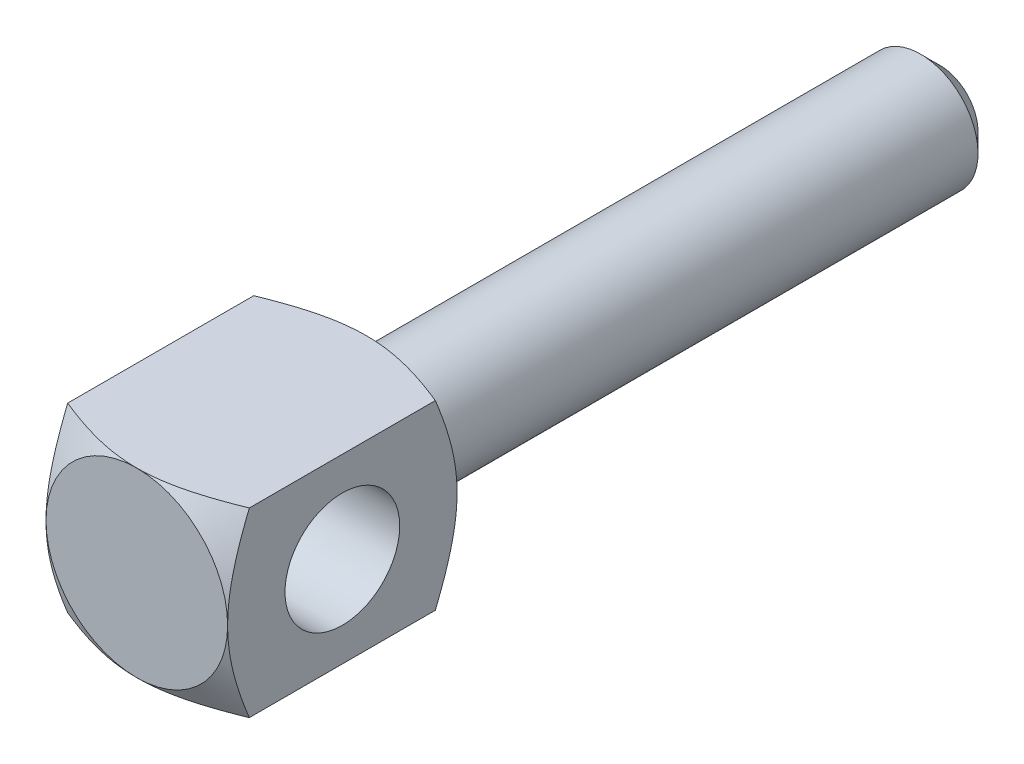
ISO-10303-21;
HEADER;
FILE_DESCRIPTION(('STEP AP214'),'2;1');
FILE_NAME('part.step','',(''),(''),'','','');
FILE_SCHEMA(('AUTOMOTIVE_DESIGN { 1 0 10303 214 1 1 1 1 }'));
ENDSEC;
DATA;
#1=APPLICATION_CONTEXT('core data for automotive mechanical design processes');
#2=APPLICATION_PROTOCOL_DEFINITION('international standard','automotive_design',2000,#1);
#3=PRODUCT_CONTEXT('',#1,'mechanical');
#4=PRODUCT('Part','Part','',(#3));
#5=PRODUCT_RELATED_PRODUCT_CATEGORY('part','',(#4));
#6=PRODUCT_DEFINITION_FORMATION('','',#4);
#7=PRODUCT_DEFINITION_CONTEXT('part definition',#1,'design');
#8=PRODUCT_DEFINITION('design','',#6,#7);
#9=PRODUCT_DEFINITION_SHAPE('','',#8);
#10=(LENGTH_UNIT() NAMED_UNIT(*) SI_UNIT(.MILLI.,.METRE.));
#11=(NAMED_UNIT(*) PLANE_ANGLE_UNIT() SI_UNIT($,.RADIAN.));
#12=(NAMED_UNIT(*) SI_UNIT($,.STERADIAN.) SOLID_ANGLE_UNIT());
#13=UNCERTAINTY_MEASURE_WITH_UNIT(LENGTH_MEASURE(1.E-05),#10,'distance_accuracy_value','');
#14=(GEOMETRIC_REPRESENTATION_CONTEXT(3) GLOBAL_UNCERTAINTY_ASSIGNED_CONTEXT((#13)) GLOBAL_UNIT_ASSIGNED_CONTEXT((#10,
#11,#12)) REPRESENTATION_CONTEXT('',''));
#15=CARTESIAN_POINT('',(0.,0.,0.));
#16=DIRECTION('',(0.,0.,1.));
#17=DIRECTION('',(1.,0.,0.));
#18=AXIS2_PLACEMENT_3D('',#15,#16,#17);
#19=CARTESIAN_POINT('',(0.,-6.,60.));
#20=DIRECTION('',(0.,0.,1.));
#21=DIRECTION('',(0.,-1.,0.));
#22=AXIS2_PLACEMENT_3D('',#19,#20,#21);
#23=PLANE('',#22);
#24=CARTESIAN_POINT('',(0.,0.,60.));
#25=DIRECTION('',(0.,0.,1.));
#26=DIRECTION('',(0.,-1.,0.));
#27=AXIS2_PLACEMENT_3D('',#24,#25,#26);
#28=CIRCLE('',#27,6.);
#29=CARTESIAN_POINT('',(0.,-6.,60.));
#30=VERTEX_POINT('',#29);
#31=EDGE_CURVE('E191',#30,#30,#28,.T.);
#32=ORIENTED_EDGE('',*,*,#31,.T.);
#33=EDGE_LOOP('',(#32));
#34=FACE_BOUND('',#33,.T.);
#35=CARTESIAN_POINT('',(0.,0.,60.));
#36=DIRECTION('',(0.,0.,1.));
#37=DIRECTION('',(0.,-1.,0.));
#38=AXIS2_PLACEMENT_3D('',#35,#36,#37);
#39=CIRCLE('',#38,9.5);
#40=CARTESIAN_POINT('',(0.,-9.5,60.));
#41=VERTEX_POINT('',#40);
#42=CARTESIAN_POINT('',(9.5,0.,60.));
#43=VERTEX_POINT('',#42);
#44=EDGE_CURVE('E82',#41,#43,#39,.T.);
#45=ORIENTED_EDGE('',*,*,#44,.F.);
#46=CARTESIAN_POINT('',(0.,0.,60.));
#47=DIRECTION('',(0.,0.,1.));
#48=DIRECTION('',(0.,-1.,0.));
#49=AXIS2_PLACEMENT_3D('',#46,#47,#48);
#50=CIRCLE('',#49,9.5);
#51=CARTESIAN_POINT('',(-9.5,0.,60.));
#52=VERTEX_POINT('',#51);
#53=EDGE_CURVE('E18',#52,#41,#50,.T.);
#54=ORIENTED_EDGE('',*,*,#53,.F.);
#55=CARTESIAN_POINT('',(0.,9.5,60.));
#56=VERTEX_POINT('',#55);
#57=EDGE_CURVE('E23',#56,#52,#50,.T.);
#58=ORIENTED_EDGE('',*,*,#57,.F.);
#59=EDGE_CURVE('E9',#43,#56,#50,.T.);
#60=ORIENTED_EDGE('',*,*,#59,.F.);
#61=EDGE_LOOP('',(#45,#54,#58,#60));
#62=FACE_BOUND('',#61,.T.);
#63=ADVANCED_FACE('F14',(#34,#62),#23,.F.);
#64=CARTESIAN_POINT('',(0.,0.,0.));
#65=DIRECTION('',(0.,0.,1.));
#66=DIRECTION('',(0.,-1.,0.));
#67=AXIS2_PLACEMENT_3D('',#64,#65,#66);
#68=PLANE('',#67);
#69=CARTESIAN_POINT('',(0.,0.,0.));
#70=DIRECTION('',(0.,0.,1.));
#71=DIRECTION('',(0.,-1.,0.));
#72=AXIS2_PLACEMENT_3D('',#69,#70,#71);
#73=CIRCLE('',#72,4.);
#74=CARTESIAN_POINT('',(0.,-4.,0.));
#75=VERTEX_POINT('',#74);
#76=EDGE_CURVE('E197',#75,#75,#73,.T.);
#77=ORIENTED_EDGE('',*,*,#76,.F.);
#78=EDGE_LOOP('',(#77));
#79=FACE_BOUND('',#78,.T.);
#80=ADVANCED_FACE('F16',(#79),#68,.F.);
#81=CARTESIAN_POINT('',(0.,0.,2.));
#82=DIRECTION('',(0.,0.,1.));
#83=DIRECTION('',(0.,-1.,0.));
#84=AXIS2_PLACEMENT_3D('',#81,#82,#83);
#85=CONICAL_SURFACE('',#84,6.,0.785398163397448);
#86=ORIENTED_EDGE('',*,*,#76,.T.);
#87=EDGE_LOOP('',(#86));
#88=FACE_BOUND('',#87,.T.);
#89=CARTESIAN_POINT('',(0.,0.,2.));
#90=DIRECTION('',(0.,0.,1.));
#91=DIRECTION('',(0.,-1.,0.));
#92=AXIS2_PLACEMENT_3D('',#89,#90,#91);
#93=CIRCLE('',#92,6.);
#94=CARTESIAN_POINT('',(0.,-6.,2.));
#95=VERTEX_POINT('',#94);
#96=EDGE_CURVE('E194',#95,#95,#93,.T.);
#97=ORIENTED_EDGE('',*,*,#96,.F.);
#98=EDGE_LOOP('',(#97));
#99=FACE_BOUND('',#98,.T.);
#100=ADVANCED_FACE('F251',(#88,#99),#85,.T.);
#101=CARTESIAN_POINT('',(0.,0.,140.));
#102=DIRECTION('',(0.,0.,1.));
#103=DIRECTION('',(0.,-1.,0.));
#104=AXIS2_PLACEMENT_3D('',#101,#102,#103);
#105=CYLINDRICAL_SURFACE('',#104,6.);
#106=ORIENTED_EDGE('',*,*,#31,.F.);
#107=EDGE_LOOP('',(#106));
#108=FACE_BOUND('',#107,.T.);
#109=ORIENTED_EDGE('',*,*,#96,.T.);
#110=EDGE_LOOP('',(#109));
#111=FACE_BOUND('',#110,.T.);
#112=ADVANCED_FACE('F254',(#108,#111),#105,.T.);
#113=CARTESIAN_POINT('',(0.,0.,65.8385285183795));
#114=DIRECTION('',(0.,0.,1.));
#115=DIRECTION('',(0.,-1.,0.));
#116=AXIS2_PLACEMENT_3D('',#113,#114,#115);
#117=CONICAL_SURFACE('',#116,19.6126280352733,1.0471975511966);
#118=CARTESIAN_POINT('',(-18.8043565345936,-9.5,66.6786947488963));
#119=CARTESIAN_POINT('',(-18.3434759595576,-9.5,66.4412305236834));
#120=CARTESIAN_POINT('',(-17.881896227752,-9.5,66.205109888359));
#121=CARTESIAN_POINT('',(-16.9569766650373,-9.5,65.7362735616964));
#122=CARTESIAN_POINT('',(-16.4936367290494,-9.5,65.5035580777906));
#123=CARTESIAN_POINT('',(-15.5638067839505,-9.5,65.0417404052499));
#124=CARTESIAN_POINT('',(-15.0973119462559,-9.5,64.8126479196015));
#125=CARTESIAN_POINT('',(-14.161811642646,-9.5,64.3596623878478));
#126=CARTESIAN_POINT('',(-13.6928062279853,-9.5,64.1357692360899));
#127=CARTESIAN_POINT('',(-12.7255417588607,-9.5,63.6822388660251));
#128=CARTESIAN_POINT('',(-12.2271070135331,-9.5,63.4529752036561));
#129=CARTESIAN_POINT('',(-11.2259656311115,-9.5,63.0038496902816));
#130=CARTESIAN_POINT('',(-10.7232587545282,-9.5,62.7839883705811));
#131=CARTESIAN_POINT('',(-9.7130306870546,-9.5,62.3568285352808));
#132=CARTESIAN_POINT('',(-9.20551409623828,-9.5,62.1495191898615));
#133=CARTESIAN_POINT('',(-8.1840599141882,-9.5,61.7513478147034));
#134=CARTESIAN_POINT('',(-7.67012316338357,-9.5,61.5604836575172));
#135=CARTESIAN_POINT('',(-6.8963253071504,-9.5,61.2917911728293));
#136=CARTESIAN_POINT('',(-6.63936575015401,-9.5,61.2055979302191));
#137=CARTESIAN_POINT('',(-6.12344290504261,-9.5,61.0395024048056));
#138=CARTESIAN_POINT('',(-5.86447982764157,-9.5,60.9595994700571));
#139=CARTESIAN_POINT('',(-5.34442646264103,-9.5,60.8070397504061));
#140=CARTESIAN_POINT('',(-5.08333629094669,-9.5,60.7343825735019));
#141=CARTESIAN_POINT('',(-4.55890792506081,-9.5,60.597356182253));
#142=CARTESIAN_POINT('',(-4.29556896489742,-9.5,60.5329899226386));
#143=CARTESIAN_POINT('',(-3.5125693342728,-9.5,60.3564276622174));
#144=CARTESIAN_POINT('',(-2.98970125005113,-9.5,60.2576861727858));
#145=CARTESIAN_POINT('',(-2.20066734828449,-9.5,60.1433146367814));
#146=CARTESIAN_POINT('',(-1.93688113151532,-9.5,60.1108150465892));
#147=CARTESIAN_POINT('',(-1.40811062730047,-9.5,60.0578865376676));
#148=CARTESIAN_POINT('',(-1.14312648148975,-9.5,60.0374562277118));
#149=CARTESIAN_POINT('',(-0.556660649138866,-9.5,60.0063080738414));
#150=CARTESIAN_POINT('',(-0.235017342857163,-9.5,59.9985365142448));
#151=CARTESIAN_POINT('',(0.408130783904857,-9.5,60.0019187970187));
#152=CARTESIAN_POINT('',(0.729635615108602,-9.5,60.0130707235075));
#153=CARTESIAN_POINT('',(1.37155007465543,-9.5,60.05380413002));
#154=CARTESIAN_POINT('',(1.69195937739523,-9.5,60.0833906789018));
#155=CARTESIAN_POINT('',(2.33071260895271,-9.5,60.1597726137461));
#156=CARTESIAN_POINT('',(2.64905641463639,-9.5,60.2065690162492));
#157=CARTESIAN_POINT('',(3.29176998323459,-9.5,60.3171557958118));
#158=CARTESIAN_POINT('',(3.61606468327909,-9.5,60.3813781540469));
#159=CARTESIAN_POINT('',(4.26147224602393,-9.5,60.5240890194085));
#160=CARTESIAN_POINT('',(4.5825850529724,-9.5,60.6025777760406));
#161=CARTESIAN_POINT('',(5.22170110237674,-9.5,60.7717808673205));
#162=CARTESIAN_POINT('',(5.53970295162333,-9.5,60.8625004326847));
#163=CARTESIAN_POINT('',(6.01433188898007,-9.5,61.0062963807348));
#164=CARTESIAN_POINT('',(6.17214374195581,-9.5,61.0555137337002));
#165=CARTESIAN_POINT('',(6.48701172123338,-9.5,61.1563107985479));
#166=CARTESIAN_POINT('',(6.6440678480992,-9.5,61.207890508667));
#167=CARTESIAN_POINT('',(7.09257168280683,-9.5,61.358617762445));
#168=CARTESIAN_POINT('',(7.38312531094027,-9.5,61.4604306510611));
#169=CARTESIAN_POINT('',(7.96193945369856,-9.5,61.6703990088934));
#170=CARTESIAN_POINT('',(8.25019982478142,-9.5,61.7785548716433));
#171=CARTESIAN_POINT('',(8.82470538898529,-9.5,62.0002632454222));
#172=CARTESIAN_POINT('',(9.11095012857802,-9.5,62.1138169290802));
#173=CARTESIAN_POINT('',(9.68158558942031,-9.5,62.3454985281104));
#174=CARTESIAN_POINT('',(9.9659762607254,-9.5,62.4636265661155));
#175=CARTESIAN_POINT('',(10.8172065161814,-9.5,62.8240539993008));
#176=CARTESIAN_POINT('',(11.3815758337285,-9.5,63.0721898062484));
#177=CARTESIAN_POINT('',(12.5050583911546,-9.5,63.5798395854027));
#178=CARTESIAN_POINT('',(13.0641721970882,-9.5,63.839352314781));
#179=CARTESIAN_POINT('',(14.1801855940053,-9.5,64.3678452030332));
#180=CARTESIAN_POINT('',(14.7370715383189,-9.5,64.6368541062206));
#181=CARTESIAN_POINT('',(15.8476049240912,-9.5,65.1814875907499));
#182=CARTESIAN_POINT('',(16.4012522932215,-9.5,65.4571123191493));
#183=CARTESIAN_POINT('',(17.5056458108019,-9.5,66.0133583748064));
#184=CARTESIAN_POINT('',(18.0563933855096,-9.5,66.2939768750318));
#185=CARTESIAN_POINT('',(19.1557836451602,-9.5,66.8592901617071));
#186=CARTESIAN_POINT('',(19.7044263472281,-9.5,67.1439849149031));
#187=CARTESIAN_POINT('',(21.2002355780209,-9.5,67.9258290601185));
#188=CARTESIAN_POINT('',(22.1457018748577,-9.5,68.4262298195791));
#189=CARTESIAN_POINT('',(24.0331060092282,-9.5,69.433973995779));
#190=CARTESIAN_POINT('',(24.9750432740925,-9.5,69.9413184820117));
#191=CARTESIAN_POINT('',(26.8497925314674,-9.5,70.957577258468));
#192=CARTESIAN_POINT('',(27.7826230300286,-9.5,71.4664574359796));
#193=CARTESIAN_POINT('',(29.180244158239,-9.5,72.2325405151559));
#194=CARTESIAN_POINT('',(29.6458057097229,-9.5,72.4883391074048));
#195=CARTESIAN_POINT('',(30.5764729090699,-9.5,73.0007625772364));
#196=CARTESIAN_POINT('',(31.0415785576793,-9.5,73.2573874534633));
#197=CARTESIAN_POINT('',(31.5064859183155,-9.5,73.5143711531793));
#198=B_SPLINE_CURVE_WITH_KNOTS('',3,(#118,#119,#120,#121,#122,#123,#124,#125,#126,#127,#128,
#129,#130,#131,#132,#133,#134,#135,#136,#137,#138,#139,#140,#141,#142,#143,#144,#145,#146,#147,
#148,#149,#150,#151,#152,#153,#154,#155,#156,#157,#158,#159,#160,#161,#162,#163,#164,#165,#166,
#167,#168,#169,#170,#171,#172,#173,#174,#175,#176,#177,#178,#179,#180,#181,#182,#183,#184,#185,
#186,#187,#188,#189,#190,#191,#192,#193,#194,#195,#196,#197),.UNSPECIFIED.,.F.,.F.,(4,2,2,2,2,2,
2,2,2,2,2,2,2,2,2,2,2,2,2,2,2,2,2,2,2,2,2,2,2,2,2,2,2,2,2,2,2,2,2,4),(0.,1.55538516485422,
3.11086468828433,4.66997530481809,6.2290542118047,7.87488232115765,9.52080330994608,
11.1652833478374,12.8095503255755,13.6225759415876,14.4355171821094,15.248414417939,
16.0616005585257,17.6559938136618,18.4531083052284,19.2501308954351,20.2147760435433,
21.1793235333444,22.1441363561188,23.1090061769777,24.1004123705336,25.0918359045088,
26.0836847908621,26.579595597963,27.0755060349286,27.9990367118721,28.922624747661,
29.8464143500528,30.7702287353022,32.6195595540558,34.4686888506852,36.323998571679,
38.1793495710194,40.0336816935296,41.8879986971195,45.0971221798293,48.3067456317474,
51.4945518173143,53.0881710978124,54.6817877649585),.UNSPECIFIED.);
#199=CARTESIAN_POINT('',(-9.5,-9.5,62.2718899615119));
#200=VERTEX_POINT('',#199);
#201=EDGE_CURVE('E89',#41,#200,#198,.F.);
#202=ORIENTED_EDGE('',*,*,#201,.T.);
#203=CARTESIAN_POINT('',(-9.5,18.8043565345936,66.6786947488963));
#204=CARTESIAN_POINT('',(-9.5,18.3434759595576,66.4412305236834));
#205=CARTESIAN_POINT('',(-9.5,17.881896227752,66.205109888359));
#206=CARTESIAN_POINT('',(-9.5,16.9569766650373,65.7362735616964));
#207=CARTESIAN_POINT('',(-9.5,16.4936367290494,65.5035580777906));
#208=CARTESIAN_POINT('',(-9.5,15.5638067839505,65.0417404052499));
#209=CARTESIAN_POINT('',(-9.5,15.0973119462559,64.8126479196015));
#210=CARTESIAN_POINT('',(-9.5,14.161811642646,64.3596623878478));
#211=CARTESIAN_POINT('',(-9.5,13.6928062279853,64.1357692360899));
#212=CARTESIAN_POINT('',(-9.5,12.7255417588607,63.6822388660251));
#213=CARTESIAN_POINT('',(-9.5,12.2271070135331,63.4529752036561));
#214=CARTESIAN_POINT('',(-9.5,11.2259656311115,63.0038496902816));
#215=CARTESIAN_POINT('',(-9.5,10.7232587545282,62.7839883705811));
#216=CARTESIAN_POINT('',(-9.5,9.7130306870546,62.3568285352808));
#217=CARTESIAN_POINT('',(-9.5,9.20551409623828,62.1495191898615));
#218=CARTESIAN_POINT('',(-9.5,8.1840599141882,61.7513478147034));
#219=CARTESIAN_POINT('',(-9.5,7.67012316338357,61.5604836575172));
#220=CARTESIAN_POINT('',(-9.5,6.8963253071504,61.2917911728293));
#221=CARTESIAN_POINT('',(-9.5,6.63936575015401,61.2055979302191));
#222=CARTESIAN_POINT('',(-9.5,6.12344290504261,61.0395024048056));
#223=CARTESIAN_POINT('',(-9.5,5.86447982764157,60.9595994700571));
#224=CARTESIAN_POINT('',(-9.5,5.34442646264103,60.8070397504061));
#225=CARTESIAN_POINT('',(-9.5,5.08333629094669,60.7343825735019));
#226=CARTESIAN_POINT('',(-9.5,4.55890792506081,60.597356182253));
#227=CARTESIAN_POINT('',(-9.5,4.29556896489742,60.5329899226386));
#228=CARTESIAN_POINT('',(-9.5,3.5125693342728,60.3564276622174));
#229=CARTESIAN_POINT('',(-9.5,2.98970125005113,60.2576861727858));
#230=CARTESIAN_POINT('',(-9.5,2.20066734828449,60.1433146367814));
#231=CARTESIAN_POINT('',(-9.5,1.93688113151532,60.1108150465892));
#232=CARTESIAN_POINT('',(-9.5,1.40811062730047,60.0578865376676));
#233=CARTESIAN_POINT('',(-9.5,1.14312648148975,60.0374562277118));
#234=CARTESIAN_POINT('',(-9.5,0.556660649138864,60.0063080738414));
#235=CARTESIAN_POINT('',(-9.5,0.235017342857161,59.9985365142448));
#236=CARTESIAN_POINT('',(-9.5,-0.408130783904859,60.0019187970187));
#237=CARTESIAN_POINT('',(-9.5,-0.729635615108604,60.0130707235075));
#238=CARTESIAN_POINT('',(-9.5,-1.37155007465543,60.05380413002));
#239=CARTESIAN_POINT('',(-9.5,-1.69195937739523,60.0833906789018));
#240=CARTESIAN_POINT('',(-9.5,-2.33071260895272,60.1597726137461));
#241=CARTESIAN_POINT('',(-9.5,-2.6490564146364,60.2065690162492));
#242=CARTESIAN_POINT('',(-9.5,-3.29176998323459,60.3171557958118));
#243=CARTESIAN_POINT('',(-9.5,-3.61606468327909,60.3813781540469));
#244=CARTESIAN_POINT('',(-9.5,-4.26147224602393,60.5240890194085));
#245=CARTESIAN_POINT('',(-9.5,-4.5825850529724,60.6025777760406));
#246=CARTESIAN_POINT('',(-9.5,-5.22170110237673,60.7717808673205));
#247=CARTESIAN_POINT('',(-9.5,-5.53970295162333,60.8625004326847));
#248=CARTESIAN_POINT('',(-9.5,-6.01433188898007,61.0062963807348));
#249=CARTESIAN_POINT('',(-9.5,-6.17214374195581,61.0555137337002));
#250=CARTESIAN_POINT('',(-9.5,-6.48701172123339,61.1563107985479));
#251=CARTESIAN_POINT('',(-9.5,-6.6440678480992,61.207890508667));
#252=CARTESIAN_POINT('',(-9.5,-7.09257168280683,61.358617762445));
#253=CARTESIAN_POINT('',(-9.5,-7.38312531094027,61.4604306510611));
#254=CARTESIAN_POINT('',(-9.5,-7.96193945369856,61.6703990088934));
#255=CARTESIAN_POINT('',(-9.5,-8.25019982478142,61.7785548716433));
#256=CARTESIAN_POINT('',(-9.5,-8.82470538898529,62.0002632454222));
#257=CARTESIAN_POINT('',(-9.5,-9.11095012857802,62.1138169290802));
#258=CARTESIAN_POINT('',(-9.5,-9.68158558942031,62.3454985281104));
#259=CARTESIAN_POINT('',(-9.5,-9.9659762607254,62.4636265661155));
#260=CARTESIAN_POINT('',(-9.5,-10.8172065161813,62.8240539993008));
#261=CARTESIAN_POINT('',(-9.5,-11.3815758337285,63.0721898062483));
#262=CARTESIAN_POINT('',(-9.5,-12.5050583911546,63.5798395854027));
#263=CARTESIAN_POINT('',(-9.5,-13.0641721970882,63.8393523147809));
#264=CARTESIAN_POINT('',(-9.5,-14.1801855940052,64.3678452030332));
#265=CARTESIAN_POINT('',(-9.5,-14.7370715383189,64.6368541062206));
#266=CARTESIAN_POINT('',(-9.5,-15.8476049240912,65.1814875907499));
#267=CARTESIAN_POINT('',(-9.5,-16.4012522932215,65.4571123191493));
#268=CARTESIAN_POINT('',(-9.5,-17.5056458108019,66.0133583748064));
#269=CARTESIAN_POINT('',(-9.5,-18.0563933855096,66.2939768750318));
#270=CARTESIAN_POINT('',(-9.5,-19.1557836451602,66.8592901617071));
#271=CARTESIAN_POINT('',(-9.5,-19.7044263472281,67.1439849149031));
#272=CARTESIAN_POINT('',(-9.5,-21.2002355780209,67.9258290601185));
#273=CARTESIAN_POINT('',(-9.5,-22.1457018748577,68.4262298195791));
#274=CARTESIAN_POINT('',(-9.5,-24.0331060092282,69.433973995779));
#275=CARTESIAN_POINT('',(-9.5,-24.9750432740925,69.9413184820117));
#276=CARTESIAN_POINT('',(-9.5,-26.8497925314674,70.957577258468));
#277=CARTESIAN_POINT('',(-9.5,-27.7826230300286,71.4664574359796));
#278=CARTESIAN_POINT('',(-9.5,-29.180244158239,72.2325405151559));
#279=CARTESIAN_POINT('',(-9.5,-29.6458057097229,72.4883391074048));
#280=CARTESIAN_POINT('',(-9.5,-30.5764729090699,73.0007625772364));
#281=CARTESIAN_POINT('',(-9.5,-31.0415785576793,73.2573874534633));
#282=CARTESIAN_POINT('',(-9.5,-31.5064859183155,73.5143711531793));
#283=B_SPLINE_CURVE_WITH_KNOTS('',3,(#203,#204,#205,#206,#207,#208,#209,#210,#211,#212,#213,
#214,#215,#216,#217,#218,#219,#220,#221,#222,#223,#224,#225,#226,#227,#228,#229,#230,#231,#232,
#233,#234,#235,#236,#237,#238,#239,#240,#241,#242,#243,#244,#245,#246,#247,#248,#249,#250,#251,
#252,#253,#254,#255,#256,#257,#258,#259,#260,#261,#262,#263,#264,#265,#266,#267,#268,#269,#270,
#271,#272,#273,#274,#275,#276,#277,#278,#279,#280,#281,#282),.UNSPECIFIED.,.F.,.F.,(4,2,2,2,2,2,
2,2,2,2,2,2,2,2,2,2,2,2,2,2,2,2,2,2,2,2,2,2,2,2,2,2,2,2,2,2,2,2,2,4),(0.,1.55538516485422,
3.11086468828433,4.66997530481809,6.2290542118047,7.87488232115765,9.52080330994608,
11.1652833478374,12.8095503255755,13.6225759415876,14.4355171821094,15.248414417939,
16.0616005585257,17.6559938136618,18.4531083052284,19.2501308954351,20.2147760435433,
21.1793235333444,22.1441363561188,23.1090061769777,24.1004123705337,25.0918359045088,
26.0836847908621,26.5795955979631,27.0755060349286,27.9990367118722,28.922624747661,
29.8464143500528,30.7702287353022,32.6195595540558,34.4686888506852,36.323998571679,
38.1793495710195,40.0336816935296,41.8879986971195,45.0971221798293,48.3067456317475,
51.4945518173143,53.0881710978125,54.6817877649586),.UNSPECIFIED.);
#284=EDGE_CURVE('E96',#52,#200,#283,.T.);
#285=ORIENTED_EDGE('',*,*,#284,.F.);
#286=ORIENTED_EDGE('',*,*,#53,.T.);
#287=EDGE_LOOP('',(#202,#285,#286));
#288=FACE_BOUND('',#287,.T.);
#289=ADVANCED_FACE('F94',(#288),#117,.T.);
#290=ORIENTED_EDGE('',*,*,#57,.T.);
#291=CARTESIAN_POINT('',(-9.5,9.5,62.2718899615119));
#292=VERTEX_POINT('',#291);
#293=EDGE_CURVE('E106',#292,#52,#283,.T.);
#294=ORIENTED_EDGE('',*,*,#293,.F.);
#295=CARTESIAN_POINT('',(-18.8043565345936,9.5,66.6786947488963));
#296=CARTESIAN_POINT('',(-18.3434759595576,9.50000000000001,66.4412305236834));
#297=CARTESIAN_POINT('',(-17.881896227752,9.50000000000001,66.205109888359));
#298=CARTESIAN_POINT('',(-16.9569766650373,9.50000000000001,65.7362735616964));
#299=CARTESIAN_POINT('',(-16.4936367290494,9.50000000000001,65.5035580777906));
#300=CARTESIAN_POINT('',(-15.5638067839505,9.50000000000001,65.0417404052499));
#301=CARTESIAN_POINT('',(-15.0973119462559,9.50000000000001,64.8126479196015));
#302=CARTESIAN_POINT('',(-14.161811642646,9.50000000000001,64.3596623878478));
#303=CARTESIAN_POINT('',(-13.6928062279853,9.50000000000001,64.1357692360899));
#304=CARTESIAN_POINT('',(-12.7255417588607,9.50000000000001,63.6822388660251));
#305=CARTESIAN_POINT('',(-12.2271070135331,9.50000000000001,63.4529752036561));
#306=CARTESIAN_POINT('',(-11.2259656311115,9.50000000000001,63.0038496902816));
#307=CARTESIAN_POINT('',(-10.7232587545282,9.50000000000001,62.7839883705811));
#308=CARTESIAN_POINT('',(-9.7130306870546,9.50000000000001,62.3568285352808));
#309=CARTESIAN_POINT('',(-9.20551409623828,9.50000000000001,62.1495191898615));
#310=CARTESIAN_POINT('',(-8.18405991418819,9.5,61.7513478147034));
#311=CARTESIAN_POINT('',(-7.67012316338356,9.5,61.5604836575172));
#312=CARTESIAN_POINT('',(-6.89632530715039,9.5,61.2917911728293));
#313=CARTESIAN_POINT('',(-6.639365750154,9.50000000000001,61.2055979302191));
#314=CARTESIAN_POINT('',(-6.1234429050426,9.50000000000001,61.0395024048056));
#315=CARTESIAN_POINT('',(-5.86447982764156,9.5,60.9595994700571));
#316=CARTESIAN_POINT('',(-5.34442646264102,9.5,60.8070397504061));
#317=CARTESIAN_POINT('',(-5.08333629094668,9.5,60.7343825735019));
#318=CARTESIAN_POINT('',(-4.5589079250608,9.5,60.597356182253));
#319=CARTESIAN_POINT('',(-4.29556896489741,9.5,60.5329899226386));
#320=CARTESIAN_POINT('',(-3.51256933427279,9.5,60.3564276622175));
#321=CARTESIAN_POINT('',(-2.98970125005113,9.5,60.2576861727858));
#322=CARTESIAN_POINT('',(-2.20066734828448,9.5,60.1433146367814));
#323=CARTESIAN_POINT('',(-1.93688113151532,9.5,60.1108150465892));
#324=CARTESIAN_POINT('',(-1.40811062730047,9.5,60.0578865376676));
#325=CARTESIAN_POINT('',(-1.14312648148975,9.5,60.0374562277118));
#326=CARTESIAN_POINT('',(-0.556660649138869,9.5,60.0063080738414));
#327=CARTESIAN_POINT('',(-0.235017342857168,9.5,59.9985365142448));
#328=CARTESIAN_POINT('',(0.408130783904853,9.5,60.0019187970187));
#329=CARTESIAN_POINT('',(0.729635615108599,9.5,60.0130707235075));
#330=CARTESIAN_POINT('',(1.37155007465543,9.5,60.05380413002));
#331=CARTESIAN_POINT('',(1.69195937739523,9.5,60.0833906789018));
#332=CARTESIAN_POINT('',(2.33071260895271,9.5,60.1597726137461));
#333=CARTESIAN_POINT('',(2.64905641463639,9.5,60.2065690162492));
#334=CARTESIAN_POINT('',(3.29176998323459,9.5,60.3171557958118));
#335=CARTESIAN_POINT('',(3.61606468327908,9.5,60.3813781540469));
#336=CARTESIAN_POINT('',(4.26147224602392,9.5,60.5240890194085));
#337=CARTESIAN_POINT('',(4.5825850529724,9.5,60.6025777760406));
#338=CARTESIAN_POINT('',(5.22170110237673,9.5,60.7717808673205));
#339=CARTESIAN_POINT('',(5.53970295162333,9.5,60.8625004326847));
#340=CARTESIAN_POINT('',(6.01433188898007,9.5,61.0062963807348));
#341=CARTESIAN_POINT('',(6.17214374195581,9.5,61.0555137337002));
#342=CARTESIAN_POINT('',(6.48701172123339,9.5,61.1563107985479));
#343=CARTESIAN_POINT('',(6.6440678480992,9.5,61.207890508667));
#344=CARTESIAN_POINT('',(7.09257168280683,9.5,61.358617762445));
#345=CARTESIAN_POINT('',(7.38312531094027,9.5,61.4604306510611));
#346=CARTESIAN_POINT('',(7.96193945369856,9.5,61.6703990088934));
#347=CARTESIAN_POINT('',(8.25019982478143,9.5,61.7785548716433));
#348=CARTESIAN_POINT('',(8.8247053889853,9.5,62.0002632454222));
#349=CARTESIAN_POINT('',(9.11095012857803,9.5,62.1138169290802));
#350=CARTESIAN_POINT('',(9.68158558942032,9.5,62.3454985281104));
#351=CARTESIAN_POINT('',(9.9659762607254,9.5,62.4636265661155));
#352=CARTESIAN_POINT('',(10.8172065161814,9.5,62.8240539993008));
#353=CARTESIAN_POINT('',(11.3815758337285,9.5,63.0721898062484));
#354=CARTESIAN_POINT('',(12.5050583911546,9.5,63.5798395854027));
#355=CARTESIAN_POINT('',(13.0641721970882,9.5,63.839352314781));
#356=CARTESIAN_POINT('',(14.1801855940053,9.5,64.3678452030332));
#357=CARTESIAN_POINT('',(14.737071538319,9.5,64.6368541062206));
#358=CARTESIAN_POINT('',(15.8476049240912,9.5,65.1814875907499));
#359=CARTESIAN_POINT('',(16.4012522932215,9.5,65.4571123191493));
#360=CARTESIAN_POINT('',(17.5056458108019,9.5,66.0133583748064));
#361=CARTESIAN_POINT('',(18.0563933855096,9.5,66.2939768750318));
#362=CARTESIAN_POINT('',(19.1557836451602,9.5,66.8592901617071));
#363=CARTESIAN_POINT('',(19.7044263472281,9.5,67.1439849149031));
#364=CARTESIAN_POINT('',(21.2002355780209,9.5,67.9258290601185));
#365=CARTESIAN_POINT('',(22.1457018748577,9.5,68.4262298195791));
#366=CARTESIAN_POINT('',(24.0331060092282,9.5,69.433973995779));
#367=CARTESIAN_POINT('',(24.9750432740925,9.49999999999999,69.9413184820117));
#368=CARTESIAN_POINT('',(26.8497925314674,9.49999999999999,70.957577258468));
#369=CARTESIAN_POINT('',(27.7826230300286,9.49999999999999,71.4664574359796));
#370=CARTESIAN_POINT('',(29.180244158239,9.49999999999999,72.2325405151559));
#371=CARTESIAN_POINT('',(29.6458057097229,9.49999999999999,72.4883391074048));
#372=CARTESIAN_POINT('',(30.5764729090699,9.49999999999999,73.0007625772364));
#373=CARTESIAN_POINT('',(31.0415785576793,9.5,73.2573874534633));
#374=CARTESIAN_POINT('',(31.5064859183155,9.5,73.5143711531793));
#375=B_SPLINE_CURVE_WITH_KNOTS('',3,(#295,#296,#297,#298,#299,#300,#301,#302,#303,#304,#305,
#306,#307,#308,#309,#310,#311,#312,#313,#314,#315,#316,#317,#318,#319,#320,#321,#322,#323,#324,
#325,#326,#327,#328,#329,#330,#331,#332,#333,#334,#335,#336,#337,#338,#339,#340,#341,#342,#343,
#344,#345,#346,#347,#348,#349,#350,#351,#352,#353,#354,#355,#356,#357,#358,#359,#360,#361,#362,
#363,#364,#365,#366,#367,#368,#369,#370,#371,#372,#373,#374),.UNSPECIFIED.,.F.,.F.,(4,2,2,2,2,2,
2,2,2,2,2,2,2,2,2,2,2,2,2,2,2,2,2,2,2,2,2,2,2,2,2,2,2,2,2,2,2,2,2,4),(0.,1.55538516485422,
3.11086468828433,4.66997530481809,6.2290542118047,7.87488232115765,9.52080330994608,
11.1652833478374,12.8095503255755,13.6225759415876,14.4355171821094,15.248414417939,
16.0616005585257,17.6559938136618,18.4531083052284,19.2501308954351,20.2147760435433,
21.1793235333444,22.1441363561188,23.1090061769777,24.1004123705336,25.0918359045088,
26.0836847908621,26.579595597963,27.0755060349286,27.9990367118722,28.922624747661,
29.8464143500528,30.7702287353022,32.6195595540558,34.4686888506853,36.323998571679,
38.1793495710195,40.0336816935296,41.8879986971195,45.0971221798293,48.3067456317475,
51.4945518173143,53.0881710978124,54.6817877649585),.UNSPECIFIED.);
#376=EDGE_CURVE('E37',#56,#292,#375,.F.);
#377=ORIENTED_EDGE('',*,*,#376,.F.);
#378=EDGE_LOOP('',(#290,#294,#377));
#379=FACE_BOUND('',#378,.T.);
#380=ADVANCED_FACE('F126',(#379),#117,.T.);
#381=CARTESIAN_POINT('',(9.5,18.8043565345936,66.6786947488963));
#382=CARTESIAN_POINT('',(9.5,18.3434759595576,66.4412305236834));
#383=CARTESIAN_POINT('',(9.5,17.881896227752,66.205109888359));
#384=CARTESIAN_POINT('',(9.5,16.9569766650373,65.7362735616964));
#385=CARTESIAN_POINT('',(9.5,16.4936367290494,65.5035580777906));
#386=CARTESIAN_POINT('',(9.5,15.5638067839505,65.0417404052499));
#387=CARTESIAN_POINT('',(9.5,15.0973119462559,64.8126479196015));
#388=CARTESIAN_POINT('',(9.5,14.161811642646,64.3596623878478));
#389=CARTESIAN_POINT('',(9.5,13.6928062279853,64.1357692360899));
#390=CARTESIAN_POINT('',(9.5,12.7255417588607,63.6822388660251));
#391=CARTESIAN_POINT('',(9.5,12.2271070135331,63.4529752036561));
#392=CARTESIAN_POINT('',(9.5,11.2259656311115,63.0038496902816));
#393=CARTESIAN_POINT('',(9.5,10.7232587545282,62.7839883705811));
#394=CARTESIAN_POINT('',(9.5,9.7130306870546,62.3568285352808));
#395=CARTESIAN_POINT('',(9.5,9.20551409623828,62.1495191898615));
#396=CARTESIAN_POINT('',(9.5,8.1840599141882,61.7513478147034));
#397=CARTESIAN_POINT('',(9.5,7.67012316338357,61.5604836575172));
#398=CARTESIAN_POINT('',(9.5,6.8963253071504,61.2917911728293));
#399=CARTESIAN_POINT('',(9.5,6.63936575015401,61.2055979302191));
#400=CARTESIAN_POINT('',(9.5,6.12344290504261,61.0395024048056));
#401=CARTESIAN_POINT('',(9.5,5.86447982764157,60.9595994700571));
#402=CARTESIAN_POINT('',(9.5,5.34442646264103,60.8070397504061));
#403=CARTESIAN_POINT('',(9.5,5.08333629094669,60.7343825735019));
#404=CARTESIAN_POINT('',(9.5,4.55890792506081,60.597356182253));
#405=CARTESIAN_POINT('',(9.5,4.29556896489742,60.5329899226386));
#406=CARTESIAN_POINT('',(9.5,3.5125693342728,60.3564276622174));
#407=CARTESIAN_POINT('',(9.5,2.98970125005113,60.2576861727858));
#408=CARTESIAN_POINT('',(9.5,2.20066734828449,60.1433146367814));
#409=CARTESIAN_POINT('',(9.5,1.93688113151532,60.1108150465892));
#410=CARTESIAN_POINT('',(9.5,1.40811062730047,60.0578865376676));
#411=CARTESIAN_POINT('',(9.5,1.14312648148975,60.0374562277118));
#412=CARTESIAN_POINT('',(9.5,0.556660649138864,60.0063080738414));
#413=CARTESIAN_POINT('',(9.5,0.235017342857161,59.9985365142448));
#414=CARTESIAN_POINT('',(9.5,-0.408130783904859,60.0019187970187));
#415=CARTESIAN_POINT('',(9.5,-0.729635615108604,60.0130707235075));
#416=CARTESIAN_POINT('',(9.5,-1.37155007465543,60.05380413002));
#417=CARTESIAN_POINT('',(9.5,-1.69195937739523,60.0833906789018));
#418=CARTESIAN_POINT('',(9.5,-2.33071260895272,60.1597726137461));
#419=CARTESIAN_POINT('',(9.5,-2.6490564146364,60.2065690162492));
#420=CARTESIAN_POINT('',(9.5,-3.29176998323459,60.3171557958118));
#421=CARTESIAN_POINT('',(9.5,-3.61606468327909,60.3813781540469));
#422=CARTESIAN_POINT('',(9.5,-4.26147224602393,60.5240890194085));
#423=CARTESIAN_POINT('',(9.5,-4.5825850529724,60.6025777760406));
#424=CARTESIAN_POINT('',(9.5,-5.22170110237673,60.7717808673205));
#425=CARTESIAN_POINT('',(9.5,-5.53970295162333,60.8625004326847));
#426=CARTESIAN_POINT('',(9.5,-6.01433188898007,61.0062963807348));
#427=CARTESIAN_POINT('',(9.5,-6.17214374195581,61.0555137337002));
#428=CARTESIAN_POINT('',(9.5,-6.48701172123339,61.1563107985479));
#429=CARTESIAN_POINT('',(9.5,-6.6440678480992,61.207890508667));
#430=CARTESIAN_POINT('',(9.5,-7.09257168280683,61.358617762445));
#431=CARTESIAN_POINT('',(9.5,-7.38312531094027,61.4604306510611));
#432=CARTESIAN_POINT('',(9.5,-7.96193945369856,61.6703990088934));
#433=CARTESIAN_POINT('',(9.5,-8.25019982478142,61.7785548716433));
#434=CARTESIAN_POINT('',(9.5,-8.82470538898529,62.0002632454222));
#435=CARTESIAN_POINT('',(9.5,-9.11095012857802,62.1138169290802));
#436=CARTESIAN_POINT('',(9.5,-9.68158558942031,62.3454985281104));
#437=CARTESIAN_POINT('',(9.5,-9.9659762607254,62.4636265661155));
#438=CARTESIAN_POINT('',(9.5,-10.8172065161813,62.8240539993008));
#439=CARTESIAN_POINT('',(9.5,-11.3815758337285,63.0721898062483));
#440=CARTESIAN_POINT('',(9.5,-12.5050583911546,63.5798395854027));
#441=CARTESIAN_POINT('',(9.5,-13.0641721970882,63.8393523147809));
#442=CARTESIAN_POINT('',(9.5,-14.1801855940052,64.3678452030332));
#443=CARTESIAN_POINT('',(9.5,-14.7370715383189,64.6368541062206));
#444=CARTESIAN_POINT('',(9.5,-15.8476049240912,65.1814875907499));
#445=CARTESIAN_POINT('',(9.5,-16.4012522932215,65.4571123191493));
#446=CARTESIAN_POINT('',(9.5,-17.5056458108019,66.0133583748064));
#447=CARTESIAN_POINT('',(9.5,-18.0563933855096,66.2939768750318));
#448=CARTESIAN_POINT('',(9.5,-19.1557836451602,66.8592901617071));
#449=CARTESIAN_POINT('',(9.5,-19.7044263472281,67.1439849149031));
#450=CARTESIAN_POINT('',(9.5,-21.2002355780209,67.9258290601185));
#451=CARTESIAN_POINT('',(9.5,-22.1457018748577,68.4262298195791));
#452=CARTESIAN_POINT('',(9.5,-24.0331060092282,69.433973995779));
#453=CARTESIAN_POINT('',(9.5,-24.9750432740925,69.9413184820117));
#454=CARTESIAN_POINT('',(9.5,-26.8497925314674,70.957577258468));
#455=CARTESIAN_POINT('',(9.5,-27.7826230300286,71.4664574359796));
#456=CARTESIAN_POINT('',(9.5,-29.180244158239,72.2325405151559));
#457=CARTESIAN_POINT('',(9.5,-29.6458057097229,72.4883391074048));
#458=CARTESIAN_POINT('',(9.5,-30.5764729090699,73.0007625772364));
#459=CARTESIAN_POINT('',(9.5,-31.0415785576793,73.2573874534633));
#460=CARTESIAN_POINT('',(9.5,-31.5064859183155,73.5143711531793));
#461=B_SPLINE_CURVE_WITH_KNOTS('',3,(#381,#382,#383,#384,#385,#386,#387,#388,#389,#390,#391,
#392,#393,#394,#395,#396,#397,#398,#399,#400,#401,#402,#403,#404,#405,#406,#407,#408,#409,#410,
#411,#412,#413,#414,#415,#416,#417,#418,#419,#420,#421,#422,#423,#424,#425,#426,#427,#428,#429,
#430,#431,#432,#433,#434,#435,#436,#437,#438,#439,#440,#441,#442,#443,#444,#445,#446,#447,#448,
#449,#450,#451,#452,#453,#454,#455,#456,#457,#458,#459,#460),.UNSPECIFIED.,.F.,.F.,(4,2,2,2,2,2,
2,2,2,2,2,2,2,2,2,2,2,2,2,2,2,2,2,2,2,2,2,2,2,2,2,2,2,2,2,2,2,2,2,4),(0.,1.55538516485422,
3.11086468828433,4.66997530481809,6.2290542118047,7.87488232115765,9.52080330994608,
11.1652833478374,12.8095503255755,13.6225759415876,14.4355171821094,15.248414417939,
16.0616005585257,17.6559938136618,18.4531083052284,19.2501308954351,20.2147760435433,
21.1793235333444,22.1441363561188,23.1090061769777,24.1004123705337,25.0918359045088,
26.0836847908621,26.5795955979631,27.0755060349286,27.9990367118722,28.922624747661,
29.8464143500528,30.7702287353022,32.6195595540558,34.4686888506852,36.323998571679,
38.1793495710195,40.0336816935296,41.8879986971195,45.0971221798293,48.3067456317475,
51.4945518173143,53.0881710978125,54.6817877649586),.UNSPECIFIED.);
#462=CARTESIAN_POINT('',(9.5,9.5,62.2718899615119));
#463=VERTEX_POINT('',#462);
#464=EDGE_CURVE('E29',#463,#43,#461,.T.);
#465=ORIENTED_EDGE('',*,*,#464,.T.);
#466=ORIENTED_EDGE('',*,*,#59,.T.);
#467=EDGE_CURVE('E223',#463,#56,#375,.F.);
#468=ORIENTED_EDGE('',*,*,#467,.F.);
#469=EDGE_LOOP('',(#465,#466,#468));
#470=FACE_BOUND('',#469,.T.);
#471=ADVANCED_FACE('F290',(#470),#117,.T.);
#472=CARTESIAN_POINT('',(9.5,-9.5,62.2718899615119));
#473=VERTEX_POINT('',#472);
#474=EDGE_CURVE('E85',#43,#473,#461,.T.);
#475=ORIENTED_EDGE('',*,*,#474,.T.);
#476=EDGE_CURVE('E78',#473,#41,#198,.F.);
#477=ORIENTED_EDGE('',*,*,#476,.T.);
#478=ORIENTED_EDGE('',*,*,#44,.T.);
#479=EDGE_LOOP('',(#475,#477,#478));
#480=FACE_BOUND('',#479,.T.);
#481=ADVANCED_FACE('F80',(#480),#117,.T.);
#482=CARTESIAN_POINT('',(0.,-14.,84.));
#483=DIRECTION('',(0.,0.,-1.));
#484=DIRECTION('',(0.,1.,0.));
#485=AXIS2_PLACEMENT_3D('',#482,#483,#484);
#486=PLANE('',#485);
#487=CARTESIAN_POINT('',(0.,0.,84.));
#488=DIRECTION('',(0.,0.,-1.));
#489=DIRECTION('',(0.,1.,0.));
#490=AXIS2_PLACEMENT_3D('',#487,#488,#489);
#491=CIRCLE('',#490,9.5);
#492=CARTESIAN_POINT('',(0.,9.5,84.));
#493=VERTEX_POINT('',#492);
#494=CARTESIAN_POINT('',(9.5,0.,84.));
#495=VERTEX_POINT('',#494);
#496=EDGE_CURVE('E100',#493,#495,#491,.T.);
#497=ORIENTED_EDGE('',*,*,#496,.F.);
#498=CARTESIAN_POINT('',(-9.5,0.,84.));
#499=VERTEX_POINT('',#498);
#500=EDGE_CURVE('E200',#499,#493,#491,.T.);
#501=ORIENTED_EDGE('',*,*,#500,.F.);
#502=CARTESIAN_POINT('',(0.,-9.5,84.));
#503=VERTEX_POINT('',#502);
#504=EDGE_CURVE('E203',#503,#499,#491,.T.);
#505=ORIENTED_EDGE('',*,*,#504,.F.);
#506=CARTESIAN_POINT('',(0.,0.,84.));
#507=DIRECTION('',(0.,0.,1.));
#508=DIRECTION('',(0.,-1.,0.));
#509=AXIS2_PLACEMENT_3D('',#506,#507,#508);
#510=CIRCLE('',#509,9.5);
#511=EDGE_CURVE('E218',#503,#495,#510,.T.);
#512=ORIENTED_EDGE('',*,*,#511,.T.);
#513=EDGE_LOOP('',(#497,#501,#505,#512));
#514=FACE_BOUND('',#513,.T.);
#515=ADVANCED_FACE('F219',(#514),#486,.F.);
#516=CARTESIAN_POINT('',(0.,0.,84.));
#517=DIRECTION('',(0.,0.,-1.));
#518=DIRECTION('',(0.,1.,0.));
#519=AXIS2_PLACEMENT_3D('',#516,#517,#518);
#520=CONICAL_SURFACE('',#519,9.5,1.0471975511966);
#521=CARTESIAN_POINT('',(9.5,18.8289468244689,77.3086316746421));
#522=CARTESIAN_POINT('',(9.5,18.36773544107,77.5463295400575));
#523=CARTESIAN_POINT('',(9.5,17.9058259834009,77.7826862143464));
#524=CARTESIAN_POINT('',(9.5,16.9802497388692,78.2520008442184));
#525=CARTESIAN_POINT('',(9.5,16.5165828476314,78.4849585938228));
#526=CARTESIAN_POINT('',(9.5,15.5861062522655,78.9472667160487));
#527=CARTESIAN_POINT('',(9.5,15.119291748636,79.1766074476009));
#528=CARTESIAN_POINT('',(9.5,14.183155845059,79.6300995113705));
#529=CARTESIAN_POINT('',(9.5,13.7138344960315,79.854250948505));
#530=CARTESIAN_POINT('',(9.5,12.7458874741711,80.3083430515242));
#531=CARTESIAN_POINT('',(9.5,12.2470861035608,80.537910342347));
#532=CARTESIAN_POINT('',(9.5,11.2452164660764,80.9876600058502));
#533=CARTESIAN_POINT('',(9.5,10.7421479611,81.2078418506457));
#534=CARTESIAN_POINT('',(9.5,9.7312000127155,81.6356649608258));
#535=CARTESIAN_POINT('',(9.5,9.22332514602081,81.8433169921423));
#536=CARTESIAN_POINT('',(9.5,8.2011579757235,82.2422010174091));
#537=CARTESIAN_POINT('',(9.5,7.68686650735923,82.4334351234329));
#538=CARTESIAN_POINT('',(9.5,6.91254478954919,82.7027022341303));
#539=CARTESIAN_POINT('',(9.5,6.65541619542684,82.7890881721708));
#540=CARTESIAN_POINT('',(9.5,6.13915457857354,82.9555774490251));
#541=CARTESIAN_POINT('',(9.5,5.88002176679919,83.0356814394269));
#542=CARTESIAN_POINT('',(9.5,5.35962675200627,83.1886516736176));
#543=CARTESIAN_POINT('',(9.5,5.09836466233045,83.2615182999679));
#544=CARTESIAN_POINT('',(9.5,4.57358892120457,83.3989710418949));
#545=CARTESIAN_POINT('',(9.5,4.31007450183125,83.4635542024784));
#546=CARTESIAN_POINT('',(9.5,3.52656606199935,83.6407632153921));
#547=CARTESIAN_POINT('',(9.5,3.00335766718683,83.7399441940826));
#548=CARTESIAN_POINT('',(9.5,2.21378788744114,83.8549716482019));
#549=CARTESIAN_POINT('',(9.5,1.94981900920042,83.8876893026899));
#550=CARTESIAN_POINT('',(9.5,1.42067357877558,83.9410469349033));
#551=CARTESIAN_POINT('',(9.5,1.15549716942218,83.9616883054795));
#552=CARTESIAN_POINT('',(9.5,0.56824170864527,83.9933072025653));
#553=CARTESIAN_POINT('',(9.5,0.245997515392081,84.0013148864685));
#554=CARTESIAN_POINT('',(9.5,-0.398364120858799,83.9983323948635));
#555=CARTESIAN_POINT('',(9.5,-0.720481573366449,83.98734413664));
#556=CARTESIAN_POINT('',(9.5,-1.36362553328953,83.9468604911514));
#557=CARTESIAN_POINT('',(9.5,-1.68465171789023,83.917360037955));
#558=CARTESIAN_POINT('',(9.5,-2.32463621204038,83.8410746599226));
#559=CARTESIAN_POINT('',(9.5,-2.64359439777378,83.7942887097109));
#560=CARTESIAN_POINT('',(9.5,-3.28756374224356,83.6836510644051));
#561=CARTESIAN_POINT('',(9.5,-3.61249945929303,83.6193645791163));
#562=CARTESIAN_POINT('',(9.5,-4.25917720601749,83.4764636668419));
#563=CARTESIAN_POINT('',(9.5,-4.58091917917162,83.39784898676));
#564=CARTESIAN_POINT('',(9.5,-5.22128333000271,83.2283439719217));
#565=CARTESIAN_POINT('',(9.5,-5.53990408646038,83.1374483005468));
#566=CARTESIAN_POINT('',(9.5,-6.01545222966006,82.9933593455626));
#567=CARTESIAN_POINT('',(9.5,-6.17356896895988,82.9440395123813));
#568=CARTESIAN_POINT('',(9.5,-6.48904388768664,82.8430290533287));
#569=CARTESIAN_POINT('',(9.5,-6.6464020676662,82.7913384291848));
#570=CARTESIAN_POINT('',(9.5,-7.09512872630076,82.6404976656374));
#571=CARTESIAN_POINT('',(9.5,-7.38560534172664,82.5386895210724));
#572=CARTESIAN_POINT('',(9.5,-7.96426717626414,82.3287366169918));
#573=CARTESIAN_POINT('',(9.5,-8.25245225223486,82.2205914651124));
#574=CARTESIAN_POINT('',(9.5,-8.82680866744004,81.9989093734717));
#575=CARTESIAN_POINT('',(9.5,-9.11297955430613,81.8853712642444));
#576=CARTESIAN_POINT('',(9.5,-9.68346868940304,81.6537247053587));
#577=CARTESIAN_POINT('',(9.5,-9.96778688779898,81.5356161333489));
#578=CARTESIAN_POINT('',(9.5,-10.8188004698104,81.1752521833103));
#579=CARTESIAN_POINT('',(9.5,-11.3830273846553,80.9271650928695));
#580=CARTESIAN_POINT('',(9.5,-12.5062287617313,80.4196207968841));
#581=CARTESIAN_POINT('',(9.5,-13.0652037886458,80.1601648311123));
#582=CARTESIAN_POINT('',(9.5,-14.1809357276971,79.6317938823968));
#583=CARTESIAN_POINT('',(9.5,-14.7376790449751,79.3628502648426));
#584=CARTESIAN_POINT('',(9.5,-15.847929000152,78.8183511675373));
#585=CARTESIAN_POINT('',(9.5,-16.4014355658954,78.5427955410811));
#586=CARTESIAN_POINT('',(9.5,-17.5055493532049,77.986690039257));
#587=CARTESIAN_POINT('',(9.5,-18.0561579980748,77.7061429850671));
#588=CARTESIAN_POINT('',(9.5,-19.1552713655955,77.1409744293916));
#589=CARTESIAN_POINT('',(9.5,-19.7037761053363,76.8563529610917));
#590=CARTESIAN_POINT('',(9.5,-21.1991894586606,76.0747212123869));
#591=CARTESIAN_POINT('',(9.5,-22.1443986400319,75.5744610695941));
#592=CARTESIAN_POINT('',(9.5,-24.031289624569,74.5670007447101));
#593=CARTESIAN_POINT('',(9.5,-24.9729708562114,74.0597994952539));
#594=CARTESIAN_POINT('',(9.5,-26.8472233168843,73.0438208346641));
#595=CARTESIAN_POINT('',(9.5,-27.7798130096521,72.5350774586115));
#596=CARTESIAN_POINT('',(9.5,-29.1770734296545,71.7692001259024));
#597=CARTESIAN_POINT('',(9.5,-29.6425148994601,71.5134701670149));
#598=CARTESIAN_POINT('',(9.5,-30.572942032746,71.0011841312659));
#599=CARTESIAN_POINT('',(9.5,-31.0379276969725,70.7446280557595));
#600=CARTESIAN_POINT('',(9.5,-31.502715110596,70.4877132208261));
#601=B_SPLINE_CURVE_WITH_KNOTS('',3,(#521,#522,#523,#524,#525,#526,#527,#528,#529,#530,#531,
#532,#533,#534,#535,#536,#537,#538,#539,#540,#541,#542,#543,#544,#545,#546,#547,#548,#549,#550,
#551,#552,#553,#554,#555,#556,#557,#558,#559,#560,#561,#562,#563,#564,#565,#566,#567,#568,#569,
#570,#571,#572,#573,#574,#575,#576,#577,#578,#579,#580,#581,#582,#583,#584,#585,#586,#587,#588,
#589,#590,#591,#592,#593,#594,#595,#596,#597,#598,#599,#600),.UNSPECIFIED.,.F.,.F.,(4,2,2,2,2,2,
2,2,2,2,2,2,2,2,2,2,2,2,2,2,2,2,2,2,2,2,2,2,2,2,2,2,2,2,2,2,2,2,2,4),(0.,1.5565883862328,
3.11327071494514,4.67357054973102,6.23383881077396,7.88104715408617,9.52834802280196,
11.1742127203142,12.8198653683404,13.6335559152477,14.4471619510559,15.2607249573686,
16.0745773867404,17.6702209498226,18.4679593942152,19.2656058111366,20.2320673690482,
21.1984313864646,22.1650599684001,23.1317458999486,24.1250733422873,25.11841833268,
26.1121963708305,26.6090718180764,27.1059469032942,28.0292550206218,28.9526203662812,
29.8761868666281,30.7997781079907,32.6486592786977,34.4973393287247,36.3521786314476,
38.2070591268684,40.0609225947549,41.9147709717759,45.1230153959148,48.3317588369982,
51.5187342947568,53.1119386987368,54.7051404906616),.UNSPECIFIED.);
#602=CARTESIAN_POINT('',(9.5,9.5,81.7281100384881));
#603=VERTEX_POINT('',#602);
#604=EDGE_CURVE('E179',#495,#603,#601,.F.);
#605=ORIENTED_EDGE('',*,*,#604,.T.);
#606=CARTESIAN_POINT('',(-18.8289468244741,9.5,77.3086316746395));
#607=CARTESIAN_POINT('',(-18.3677354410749,9.50000000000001,77.546329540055));
#608=CARTESIAN_POINT('',(-17.9058259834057,9.50000000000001,77.782686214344));
#609=CARTESIAN_POINT('',(-16.9802497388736,9.50000000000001,78.2520008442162));
#610=CARTESIAN_POINT('',(-16.5165828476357,9.50000000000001,78.4849585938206));
#611=CARTESIAN_POINT('',(-15.5861062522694,9.50000000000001,78.9472667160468));
#612=CARTESIAN_POINT('',(-15.1192917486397,9.50000000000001,79.1766074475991));
#613=CARTESIAN_POINT('',(-14.1831558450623,9.50000000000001,79.6300995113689));
#614=CARTESIAN_POINT('',(-13.7138344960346,9.50000000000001,79.8542509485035));
#615=CARTESIAN_POINT('',(-12.7458874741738,9.50000000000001,80.3083430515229));
#616=CARTESIAN_POINT('',(-12.2470861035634,9.50000000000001,80.5379103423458));
#617=CARTESIAN_POINT('',(-11.2452164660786,9.50000000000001,80.9876600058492));
#618=CARTESIAN_POINT('',(-10.742147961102,9.50000000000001,81.2078418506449));
#619=CARTESIAN_POINT('',(-9.73120001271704,9.50000000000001,81.6356649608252));
#620=CARTESIAN_POINT('',(-9.22332514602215,9.50000000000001,81.8433169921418));
#621=CARTESIAN_POINT('',(-8.20115797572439,9.5,82.2422010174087));
#622=CARTESIAN_POINT('',(-7.68686650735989,9.5,82.4334351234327));
#623=CARTESIAN_POINT('',(-6.91254478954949,9.5,82.7027022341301));
#624=CARTESIAN_POINT('',(-6.65541619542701,9.50000000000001,82.7890881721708));
#625=CARTESIAN_POINT('',(-6.13915457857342,9.50000000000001,82.9555774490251));
#626=CARTESIAN_POINT('',(-5.88002176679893,9.5,83.0356814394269));
#627=CARTESIAN_POINT('',(-5.35962675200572,9.5,83.1886516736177));
#628=CARTESIAN_POINT('',(-5.09836466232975,9.5,83.2615182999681));
#629=CARTESIAN_POINT('',(-4.57358892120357,9.5,83.3989710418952));
#630=CARTESIAN_POINT('',(-4.3100745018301,9.5,83.4635542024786));
#631=CARTESIAN_POINT('',(-3.52656606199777,9.5,83.6407632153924));
#632=CARTESIAN_POINT('',(-3.00335766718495,9.5,83.7399441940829));
#633=CARTESIAN_POINT('',(-2.21378788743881,9.5,83.8549716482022));
#634=CARTESIAN_POINT('',(-1.94981900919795,9.5,83.8876893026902));
#635=CARTESIAN_POINT('',(-1.42067357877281,9.5,83.9410469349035));
#636=CARTESIAN_POINT('',(-1.15549716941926,9.5,83.9616883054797));
#637=CARTESIAN_POINT('',(-0.568241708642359,9.5,83.9933072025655));
#638=CARTESIAN_POINT('',(-0.245997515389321,9.5,84.0013148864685));
#639=CARTESIAN_POINT('',(0.398364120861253,9.5,83.9983323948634));
#640=CARTESIAN_POINT('',(0.720481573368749,9.5,83.9873441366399));
#641=CARTESIAN_POINT('',(1.36362553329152,9.5,83.9468604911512));
#642=CARTESIAN_POINT('',(1.68465171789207,9.5,83.9173600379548));
#643=CARTESIAN_POINT('',(2.32463621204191,9.5,83.8410746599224));
#644=CARTESIAN_POINT('',(2.64359439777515,9.5,83.7942887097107));
#645=CARTESIAN_POINT('',(3.28756374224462,9.5,83.6836510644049));
#646=CARTESIAN_POINT('',(3.61249945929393,9.5,83.6193645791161));
#647=CARTESIAN_POINT('',(4.25917720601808,9.5,83.4764636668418));
#648=CARTESIAN_POINT('',(4.58091917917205,9.5,83.3978489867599));
#649=CARTESIAN_POINT('',(5.22128333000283,9.5,83.2283439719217));
#650=CARTESIAN_POINT('',(5.53990408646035,9.5,83.1374483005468));
#651=CARTESIAN_POINT('',(6.0154522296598,9.5,82.9933593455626));
#652=CARTESIAN_POINT('',(6.17356896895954,9.5,82.9440395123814));
#653=CARTESIAN_POINT('',(6.48904388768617,9.5,82.8430290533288));
#654=CARTESIAN_POINT('',(6.64640206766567,9.5,82.791338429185));
#655=CARTESIAN_POINT('',(7.09512872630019,9.5,82.6404976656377));
#656=CARTESIAN_POINT('',(7.38560534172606,9.5,82.5386895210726));
#657=CARTESIAN_POINT('',(7.96426717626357,9.5,82.328736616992));
#658=CARTESIAN_POINT('',(8.25245225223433,9.5,82.2205914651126));
#659=CARTESIAN_POINT('',(8.82680866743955,9.5,81.9989093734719));
#660=CARTESIAN_POINT('',(9.11297955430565,9.5,81.8853712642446));
#661=CARTESIAN_POINT('',(9.6834686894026,9.5,81.6537247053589));
#662=CARTESIAN_POINT('',(9.96778688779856,9.5,81.5356161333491));
#663=CARTESIAN_POINT('',(10.81880046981,9.5,81.1752521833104));
#664=CARTESIAN_POINT('',(11.383027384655,9.5,80.9271650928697));
#665=CARTESIAN_POINT('',(12.506228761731,9.5,80.4196207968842));
#666=CARTESIAN_POINT('',(13.0652037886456,9.5,80.1601648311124));
#667=CARTESIAN_POINT('',(14.180935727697,9.5,79.6317938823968));
#668=CARTESIAN_POINT('',(14.737679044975,9.5,79.3628502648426));
#669=CARTESIAN_POINT('',(15.847929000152,9.5,78.8183511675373));
#670=CARTESIAN_POINT('',(16.4014355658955,9.5,78.5427955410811));
#671=CARTESIAN_POINT('',(17.505549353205,9.5,77.986690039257));
#672=CARTESIAN_POINT('',(18.056157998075,9.5,77.706142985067));
#673=CARTESIAN_POINT('',(19.1552713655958,9.5,77.1409744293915));
#674=CARTESIAN_POINT('',(19.7037761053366,9.5,76.8563529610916));
#675=CARTESIAN_POINT('',(21.199189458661,9.5,76.0747212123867));
#676=CARTESIAN_POINT('',(22.1443986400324,9.5,75.5744610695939));
#677=CARTESIAN_POINT('',(24.0312896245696,9.5,74.5670007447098));
#678=CARTESIAN_POINT('',(24.9729708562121,9.49999999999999,74.0597994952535));
#679=CARTESIAN_POINT('',(26.8472233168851,9.49999999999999,73.0438208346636));
#680=CARTESIAN_POINT('',(27.7798130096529,9.49999999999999,72.535077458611));
#681=CARTESIAN_POINT('',(29.1770734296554,9.49999999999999,71.7692001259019));
#682=CARTESIAN_POINT('',(29.642514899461,9.49999999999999,71.5134701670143));
#683=CARTESIAN_POINT('',(30.572942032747,9.49999999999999,71.0011841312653));
#684=CARTESIAN_POINT('',(31.0379276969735,9.5,70.744628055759));
#685=CARTESIAN_POINT('',(31.5027151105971,9.5,70.4877132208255));
#686=B_SPLINE_CURVE_WITH_KNOTS('',3,(#606,#607,#608,#609,#610,#611,#612,#613,#614,#615,#616,
#617,#618,#619,#620,#621,#622,#623,#624,#625,#626,#627,#628,#629,#630,#631,#632,#633,#634,#635,
#636,#637,#638,#639,#640,#641,#642,#643,#644,#645,#646,#647,#648,#649,#650,#651,#652,#653,#654,
#655,#656,#657,#658,#659,#660,#661,#662,#663,#664,#665,#666,#667,#668,#669,#670,#671,#672,#673,
#674,#675,#676,#677,#678,#679,#680,#681,#682,#683,#684,#685),.UNSPECIFIED.,.F.,.F.,(4,2,2,2,2,2,
2,2,2,2,2,2,2,2,2,2,2,2,2,2,2,2,2,2,2,2,2,2,2,2,2,2,2,2,2,2,2,2,2,4),(0.,1.55658838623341,
3.11327071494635,4.67357054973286,6.2338388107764,7.88104715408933,9.52834802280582,
11.1742127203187,12.8198653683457,13.6335559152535,14.447161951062,15.2607249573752,
16.0745773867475,17.6702209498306,18.4679593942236,19.2656058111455,20.2320673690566,
21.1984313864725,22.1650599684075,23.1317458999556,24.1250733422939,25.118418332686,
26.1121963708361,26.6090718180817,27.1059469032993,28.029255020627,28.9526203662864,
29.8761868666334,30.7997781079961,32.6486592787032,34.4973393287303,36.3521786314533,
38.2070591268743,40.0609225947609,41.914770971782,45.1230153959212,48.3317588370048,
51.5187342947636,53.1119386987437,54.7051404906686),.UNSPECIFIED.);
#687=EDGE_CURVE('E178',#493,#603,#686,.T.);
#688=ORIENTED_EDGE('',*,*,#687,.F.);
#689=ORIENTED_EDGE('',*,*,#496,.T.);
#690=EDGE_LOOP('',(#605,#688,#689));
#691=FACE_BOUND('',#690,.T.);
#692=ADVANCED_FACE('F167',(#691),#520,.T.);
#693=CARTESIAN_POINT('',(9.5,-9.5,81.7281100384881));
#694=VERTEX_POINT('',#693);
#695=EDGE_CURVE('E172',#694,#495,#601,.F.);
#696=ORIENTED_EDGE('',*,*,#695,.T.);
#697=ORIENTED_EDGE('',*,*,#511,.F.);
#698=CARTESIAN_POINT('',(-18.8289468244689,-9.5,77.3086316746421));
#699=CARTESIAN_POINT('',(-18.36773544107,-9.5,77.5463295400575));
#700=CARTESIAN_POINT('',(-17.9058259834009,-9.5,77.7826862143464));
#701=CARTESIAN_POINT('',(-16.9802497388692,-9.5,78.2520008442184));
#702=CARTESIAN_POINT('',(-16.5165828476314,-9.5,78.4849585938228));
#703=CARTESIAN_POINT('',(-15.5861062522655,-9.5,78.9472667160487));
#704=CARTESIAN_POINT('',(-15.119291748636,-9.5,79.1766074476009));
#705=CARTESIAN_POINT('',(-14.183155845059,-9.5,79.6300995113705));
#706=CARTESIAN_POINT('',(-13.7138344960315,-9.5,79.854250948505));
#707=CARTESIAN_POINT('',(-12.7458874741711,-9.5,80.3083430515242));
#708=CARTESIAN_POINT('',(-12.2470861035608,-9.5,80.537910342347));
#709=CARTESIAN_POINT('',(-11.2452164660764,-9.5,80.9876600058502));
#710=CARTESIAN_POINT('',(-10.7421479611,-9.5,81.2078418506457));
#711=CARTESIAN_POINT('',(-9.7312000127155,-9.5,81.6356649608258));
#712=CARTESIAN_POINT('',(-9.22332514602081,-9.5,81.8433169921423));
#713=CARTESIAN_POINT('',(-8.2011579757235,-9.5,82.2422010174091));
#714=CARTESIAN_POINT('',(-7.68686650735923,-9.5,82.4334351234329));
#715=CARTESIAN_POINT('',(-6.91254478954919,-9.5,82.7027022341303));
#716=CARTESIAN_POINT('',(-6.65541619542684,-9.5,82.7890881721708));
#717=CARTESIAN_POINT('',(-6.13915457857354,-9.5,82.9555774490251));
#718=CARTESIAN_POINT('',(-5.88002176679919,-9.5,83.0356814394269));
#719=CARTESIAN_POINT('',(-5.35962675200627,-9.5,83.1886516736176));
#720=CARTESIAN_POINT('',(-5.09836466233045,-9.5,83.2615182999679));
#721=CARTESIAN_POINT('',(-4.57358892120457,-9.5,83.3989710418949));
#722=CARTESIAN_POINT('',(-4.31007450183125,-9.5,83.4635542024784));
#723=CARTESIAN_POINT('',(-3.52656606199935,-9.5,83.6407632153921));
#724=CARTESIAN_POINT('',(-3.00335766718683,-9.5,83.7399441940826));
#725=CARTESIAN_POINT('',(-2.21378788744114,-9.5,83.8549716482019));
#726=CARTESIAN_POINT('',(-1.94981900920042,-9.5,83.8876893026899));
#727=CARTESIAN_POINT('',(-1.42067357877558,-9.5,83.9410469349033));
#728=CARTESIAN_POINT('',(-1.15549716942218,-9.5,83.9616883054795));
#729=CARTESIAN_POINT('',(-0.568241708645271,-9.5,83.9933072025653));
#730=CARTESIAN_POINT('',(-0.245997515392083,-9.5,84.0013148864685));
#731=CARTESIAN_POINT('',(0.398364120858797,-9.5,83.9983323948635));
#732=CARTESIAN_POINT('',(0.720481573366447,-9.5,83.98734413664));
#733=CARTESIAN_POINT('',(1.36362553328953,-9.5,83.9468604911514));
#734=CARTESIAN_POINT('',(1.68465171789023,-9.5,83.917360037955));
#735=CARTESIAN_POINT('',(2.32463621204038,-9.5,83.8410746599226));
#736=CARTESIAN_POINT('',(2.64359439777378,-9.5,83.7942887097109));
#737=CARTESIAN_POINT('',(3.28756374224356,-9.5,83.6836510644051));
#738=CARTESIAN_POINT('',(3.61249945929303,-9.5,83.6193645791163));
#739=CARTESIAN_POINT('',(4.25917720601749,-9.5,83.4764636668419));
#740=CARTESIAN_POINT('',(4.58091917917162,-9.5,83.39784898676));
#741=CARTESIAN_POINT('',(5.2212833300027,-9.5,83.2283439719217));
#742=CARTESIAN_POINT('',(5.53990408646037,-9.5,83.1374483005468));
#743=CARTESIAN_POINT('',(6.01545222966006,-9.5,82.9933593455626));
#744=CARTESIAN_POINT('',(6.17356896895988,-9.5,82.9440395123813));
#745=CARTESIAN_POINT('',(6.48904388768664,-9.5,82.8430290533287));
#746=CARTESIAN_POINT('',(6.6464020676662,-9.5,82.7913384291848));
#747=CARTESIAN_POINT('',(7.09512872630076,-9.5,82.6404976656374));
#748=CARTESIAN_POINT('',(7.38560534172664,-9.5,82.5386895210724));
#749=CARTESIAN_POINT('',(7.96426717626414,-9.5,82.3287366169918));
#750=CARTESIAN_POINT('',(8.25245225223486,-9.5,82.2205914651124));
#751=CARTESIAN_POINT('',(8.82680866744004,-9.5,81.9989093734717));
#752=CARTESIAN_POINT('',(9.11297955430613,-9.5,81.8853712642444));
#753=CARTESIAN_POINT('',(9.68346868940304,-9.5,81.6537247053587));
#754=CARTESIAN_POINT('',(9.96778688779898,-9.5,81.5356161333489));
#755=CARTESIAN_POINT('',(10.8188004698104,-9.5,81.1752521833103));
#756=CARTESIAN_POINT('',(11.3830273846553,-9.5,80.9271650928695));
#757=CARTESIAN_POINT('',(12.5062287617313,-9.5,80.4196207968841));
#758=CARTESIAN_POINT('',(13.0652037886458,-9.5,80.1601648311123));
#759=CARTESIAN_POINT('',(14.1809357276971,-9.5,79.6317938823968));
#760=CARTESIAN_POINT('',(14.7376790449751,-9.5,79.3628502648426));
#761=CARTESIAN_POINT('',(15.847929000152,-9.5,78.8183511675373));
#762=CARTESIAN_POINT('',(16.4014355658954,-9.5,78.5427955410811));
#763=CARTESIAN_POINT('',(17.5055493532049,-9.5,77.986690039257));
#764=CARTESIAN_POINT('',(18.0561579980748,-9.5,77.7061429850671));
#765=CARTESIAN_POINT('',(19.1552713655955,-9.5,77.1409744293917));
#766=CARTESIAN_POINT('',(19.7037761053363,-9.5,76.8563529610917));
#767=CARTESIAN_POINT('',(21.1991894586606,-9.5,76.0747212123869));
#768=CARTESIAN_POINT('',(22.1443986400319,-9.5,75.5744610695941));
#769=CARTESIAN_POINT('',(24.031289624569,-9.5,74.5670007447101));
#770=CARTESIAN_POINT('',(24.9729708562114,-9.5,74.0597994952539));
#771=CARTESIAN_POINT('',(26.8472233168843,-9.5,73.043820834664));
#772=CARTESIAN_POINT('',(27.7798130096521,-9.5,72.5350774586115));
#773=CARTESIAN_POINT('',(29.1770734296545,-9.5,71.7692001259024));
#774=CARTESIAN_POINT('',(29.6425148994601,-9.5,71.5134701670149));
#775=CARTESIAN_POINT('',(30.572942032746,-9.5,71.0011841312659));
#776=CARTESIAN_POINT('',(31.0379276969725,-9.5,70.7446280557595));
#777=CARTESIAN_POINT('',(31.502715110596,-9.5,70.4877132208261));
#778=B_SPLINE_CURVE_WITH_KNOTS('',3,(#698,#699,#700,#701,#702,#703,#704,#705,#706,#707,#708,
#709,#710,#711,#712,#713,#714,#715,#716,#717,#718,#719,#720,#721,#722,#723,#724,#725,#726,#727,
#728,#729,#730,#731,#732,#733,#734,#735,#736,#737,#738,#739,#740,#741,#742,#743,#744,#745,#746,
#747,#748,#749,#750,#751,#752,#753,#754,#755,#756,#757,#758,#759,#760,#761,#762,#763,#764,#765,
#766,#767,#768,#769,#770,#771,#772,#773,#774,#775,#776,#777),.UNSPECIFIED.,.F.,.F.,(4,2,2,2,2,2,
2,2,2,2,2,2,2,2,2,2,2,2,2,2,2,2,2,2,2,2,2,2,2,2,2,2,2,2,2,2,2,2,2,4),(0.,1.5565883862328,
3.11327071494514,4.67357054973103,6.23383881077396,7.88104715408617,9.52834802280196,
11.1742127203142,12.8198653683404,13.6335559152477,14.4471619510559,15.2607249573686,
16.0745773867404,17.6702209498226,18.4679593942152,19.2656058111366,20.2320673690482,
21.1984313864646,22.1650599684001,23.1317458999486,24.1250733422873,25.11841833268,
26.1121963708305,26.6090718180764,27.1059469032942,28.0292550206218,28.9526203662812,
29.8761868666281,30.7997781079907,32.6486592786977,34.4973393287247,36.3521786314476,
38.2070591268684,40.0609225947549,41.9147709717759,45.1230153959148,48.3317588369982,
51.5187342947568,53.1119386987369,54.7051404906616),.UNSPECIFIED.);
#779=EDGE_CURVE('E148',#503,#694,#778,.T.);
#780=ORIENTED_EDGE('',*,*,#779,.T.);
#781=EDGE_LOOP('',(#696,#697,#780));
#782=FACE_BOUND('',#781,.T.);
#783=ADVANCED_FACE('F165',(#782),#520,.T.);
#784=CARTESIAN_POINT('',(-9.5,18.8289468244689,77.3086316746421));
#785=CARTESIAN_POINT('',(-9.5,18.36773544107,77.5463295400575));
#786=CARTESIAN_POINT('',(-9.5,17.9058259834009,77.7826862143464));
#787=CARTESIAN_POINT('',(-9.5,16.9802497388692,78.2520008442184));
#788=CARTESIAN_POINT('',(-9.5,16.5165828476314,78.4849585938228));
#789=CARTESIAN_POINT('',(-9.5,15.5861062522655,78.9472667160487));
#790=CARTESIAN_POINT('',(-9.5,15.119291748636,79.1766074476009));
#791=CARTESIAN_POINT('',(-9.5,14.183155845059,79.6300995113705));
#792=CARTESIAN_POINT('',(-9.5,13.7138344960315,79.854250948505));
#793=CARTESIAN_POINT('',(-9.5,12.7458874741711,80.3083430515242));
#794=CARTESIAN_POINT('',(-9.5,12.2470861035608,80.537910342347));
#795=CARTESIAN_POINT('',(-9.5,11.2452164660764,80.9876600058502));
#796=CARTESIAN_POINT('',(-9.5,10.7421479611,81.2078418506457));
#797=CARTESIAN_POINT('',(-9.5,9.7312000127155,81.6356649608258));
#798=CARTESIAN_POINT('',(-9.5,9.22332514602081,81.8433169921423));
#799=CARTESIAN_POINT('',(-9.5,8.2011579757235,82.2422010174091));
#800=CARTESIAN_POINT('',(-9.5,7.68686650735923,82.4334351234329));
#801=CARTESIAN_POINT('',(-9.5,6.91254478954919,82.7027022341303));
#802=CARTESIAN_POINT('',(-9.5,6.65541619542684,82.7890881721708));
#803=CARTESIAN_POINT('',(-9.5,6.13915457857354,82.9555774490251));
#804=CARTESIAN_POINT('',(-9.5,5.88002176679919,83.0356814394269));
#805=CARTESIAN_POINT('',(-9.5,5.35962675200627,83.1886516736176));
#806=CARTESIAN_POINT('',(-9.5,5.09836466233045,83.2615182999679));
#807=CARTESIAN_POINT('',(-9.5,4.57358892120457,83.3989710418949));
#808=CARTESIAN_POINT('',(-9.5,4.31007450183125,83.4635542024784));
#809=CARTESIAN_POINT('',(-9.5,3.52656606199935,83.6407632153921));
#810=CARTESIAN_POINT('',(-9.5,3.00335766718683,83.7399441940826));
#811=CARTESIAN_POINT('',(-9.5,2.21378788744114,83.8549716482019));
#812=CARTESIAN_POINT('',(-9.5,1.94981900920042,83.8876893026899));
#813=CARTESIAN_POINT('',(-9.5,1.42067357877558,83.9410469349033));
#814=CARTESIAN_POINT('',(-9.5,1.15549716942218,83.9616883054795));
#815=CARTESIAN_POINT('',(-9.5,0.56824170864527,83.9933072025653));
#816=CARTESIAN_POINT('',(-9.5,0.245997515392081,84.0013148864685));
#817=CARTESIAN_POINT('',(-9.5,-0.398364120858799,83.9983323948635));
#818=CARTESIAN_POINT('',(-9.5,-0.720481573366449,83.98734413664));
#819=CARTESIAN_POINT('',(-9.5,-1.36362553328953,83.9468604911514));
#820=CARTESIAN_POINT('',(-9.5,-1.68465171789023,83.917360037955));
#821=CARTESIAN_POINT('',(-9.5,-2.32463621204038,83.8410746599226));
#822=CARTESIAN_POINT('',(-9.5,-2.64359439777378,83.7942887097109));
#823=CARTESIAN_POINT('',(-9.5,-3.28756374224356,83.6836510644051));
#824=CARTESIAN_POINT('',(-9.5,-3.61249945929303,83.6193645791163));
#825=CARTESIAN_POINT('',(-9.5,-4.25917720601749,83.4764636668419));
#826=CARTESIAN_POINT('',(-9.5,-4.58091917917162,83.39784898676));
#827=CARTESIAN_POINT('',(-9.5,-5.22128333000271,83.2283439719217));
#828=CARTESIAN_POINT('',(-9.5,-5.53990408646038,83.1374483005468));
#829=CARTESIAN_POINT('',(-9.5,-6.01545222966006,82.9933593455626));
#830=CARTESIAN_POINT('',(-9.5,-6.17356896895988,82.9440395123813));
#831=CARTESIAN_POINT('',(-9.5,-6.48904388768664,82.8430290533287));
#832=CARTESIAN_POINT('',(-9.5,-6.6464020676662,82.7913384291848));
#833=CARTESIAN_POINT('',(-9.5,-7.09512872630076,82.6404976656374));
#834=CARTESIAN_POINT('',(-9.5,-7.38560534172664,82.5386895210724));
#835=CARTESIAN_POINT('',(-9.5,-7.96426717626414,82.3287366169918));
#836=CARTESIAN_POINT('',(-9.5,-8.25245225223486,82.2205914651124));
#837=CARTESIAN_POINT('',(-9.5,-8.82680866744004,81.9989093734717));
#838=CARTESIAN_POINT('',(-9.5,-9.11297955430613,81.8853712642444));
#839=CARTESIAN_POINT('',(-9.5,-9.68346868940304,81.6537247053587));
#840=CARTESIAN_POINT('',(-9.5,-9.96778688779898,81.5356161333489));
#841=CARTESIAN_POINT('',(-9.5,-10.8188004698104,81.1752521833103));
#842=CARTESIAN_POINT('',(-9.5,-11.3830273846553,80.9271650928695));
#843=CARTESIAN_POINT('',(-9.5,-12.5062287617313,80.4196207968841));
#844=CARTESIAN_POINT('',(-9.5,-13.0652037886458,80.1601648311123));
#845=CARTESIAN_POINT('',(-9.5,-14.1809357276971,79.6317938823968));
#846=CARTESIAN_POINT('',(-9.5,-14.7376790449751,79.3628502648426));
#847=CARTESIAN_POINT('',(-9.5,-15.847929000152,78.8183511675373));
#848=CARTESIAN_POINT('',(-9.5,-16.4014355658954,78.5427955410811));
#849=CARTESIAN_POINT('',(-9.5,-17.5055493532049,77.986690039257));
#850=CARTESIAN_POINT('',(-9.5,-18.0561579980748,77.7061429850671));
#851=CARTESIAN_POINT('',(-9.5,-19.1552713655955,77.1409744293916));
#852=CARTESIAN_POINT('',(-9.5,-19.7037761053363,76.8563529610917));
#853=CARTESIAN_POINT('',(-9.5,-21.1991894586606,76.0747212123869));
#854=CARTESIAN_POINT('',(-9.5,-22.1443986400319,75.5744610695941));
#855=CARTESIAN_POINT('',(-9.5,-24.031289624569,74.5670007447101));
#856=CARTESIAN_POINT('',(-9.5,-24.9729708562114,74.0597994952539));
#857=CARTESIAN_POINT('',(-9.5,-26.8472233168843,73.0438208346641));
#858=CARTESIAN_POINT('',(-9.5,-27.7798130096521,72.5350774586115));
#859=CARTESIAN_POINT('',(-9.5,-29.1770734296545,71.7692001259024));
#860=CARTESIAN_POINT('',(-9.5,-29.6425148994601,71.5134701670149));
#861=CARTESIAN_POINT('',(-9.5,-30.572942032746,71.0011841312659));
#862=CARTESIAN_POINT('',(-9.5,-31.0379276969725,70.7446280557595));
#863=CARTESIAN_POINT('',(-9.5,-31.502715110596,70.4877132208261));
#864=B_SPLINE_CURVE_WITH_KNOTS('',3,(#784,#785,#786,#787,#788,#789,#790,#791,#792,#793,#794,
#795,#796,#797,#798,#799,#800,#801,#802,#803,#804,#805,#806,#807,#808,#809,#810,#811,#812,#813,
#814,#815,#816,#817,#818,#819,#820,#821,#822,#823,#824,#825,#826,#827,#828,#829,#830,#831,#832,
#833,#834,#835,#836,#837,#838,#839,#840,#841,#842,#843,#844,#845,#846,#847,#848,#849,#850,#851,
#852,#853,#854,#855,#856,#857,#858,#859,#860,#861,#862,#863),.UNSPECIFIED.,.F.,.F.,(4,2,2,2,2,2,
2,2,2,2,2,2,2,2,2,2,2,2,2,2,2,2,2,2,2,2,2,2,2,2,2,2,2,2,2,2,2,2,2,4),(0.,1.5565883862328,
3.11327071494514,4.67357054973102,6.23383881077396,7.88104715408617,9.52834802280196,
11.1742127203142,12.8198653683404,13.6335559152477,14.4471619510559,15.2607249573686,
16.0745773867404,17.6702209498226,18.4679593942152,19.2656058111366,20.2320673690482,
21.1984313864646,22.1650599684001,23.1317458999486,24.1250733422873,25.11841833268,
26.1121963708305,26.6090718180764,27.1059469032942,28.0292550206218,28.9526203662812,
29.8761868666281,30.7997781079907,32.6486592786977,34.4973393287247,36.3521786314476,
38.2070591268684,40.0609225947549,41.9147709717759,45.1230153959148,48.3317588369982,
51.5187342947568,53.1119386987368,54.7051404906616),.UNSPECIFIED.);
#865=CARTESIAN_POINT('',(-9.5,9.5,81.7281100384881));
#866=VERTEX_POINT('',#865);
#867=EDGE_CURVE('E149',#499,#866,#864,.F.);
#868=ORIENTED_EDGE('',*,*,#867,.F.);
#869=ORIENTED_EDGE('',*,*,#500,.T.);
#870=EDGE_CURVE('E146',#866,#493,#686,.T.);
#871=ORIENTED_EDGE('',*,*,#870,.F.);
#872=EDGE_LOOP('',(#868,#869,#871));
#873=FACE_BOUND('',#872,.T.);
#874=ADVANCED_FACE('F160',(#873),#520,.T.);
#875=CARTESIAN_POINT('',(-9.5,-9.5,81.7281100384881));
#876=VERTEX_POINT('',#875);
#877=EDGE_CURVE('E139',#876,#503,#778,.T.);
#878=ORIENTED_EDGE('',*,*,#877,.T.);
#879=ORIENTED_EDGE('',*,*,#504,.T.);
#880=EDGE_CURVE('E147',#876,#499,#864,.F.);
#881=ORIENTED_EDGE('',*,*,#880,.F.);
#882=EDGE_LOOP('',(#878,#879,#881));
#883=FACE_BOUND('',#882,.T.);
#884=ADVANCED_FACE('F164',(#883),#520,.T.);
#885=CARTESIAN_POINT('',(-12.,0.,72.));
#886=DIRECTION('',(1.,0.,0.));
#887=DIRECTION('',(0.,0.,1.));
#888=AXIS2_PLACEMENT_3D('',#885,#886,#887);
#889=CYLINDRICAL_SURFACE('',#888,6.);
#890=CARTESIAN_POINT('',(-9.5,0.,72.));
#891=DIRECTION('',(-1.,0.,0.));
#892=DIRECTION('',(0.,0.,-1.));
#893=AXIS2_PLACEMENT_3D('',#890,#891,#892);
#894=CIRCLE('',#893,6.);
#895=CARTESIAN_POINT('',(-9.5,0.,66.));
#896=VERTEX_POINT('',#895);
#897=EDGE_CURVE('E184',#896,#896,#894,.T.);
#898=ORIENTED_EDGE('',*,*,#897,.T.);
#899=EDGE_LOOP('',(#898));
#900=FACE_BOUND('',#899,.T.);
#901=CARTESIAN_POINT('',(9.5,0.,72.));
#902=DIRECTION('',(-1.,0.,0.));
#903=DIRECTION('',(0.,0.,-1.));
#904=AXIS2_PLACEMENT_3D('',#901,#902,#903);
#905=CIRCLE('',#904,6.);
#906=CARTESIAN_POINT('',(9.5,0.,66.));
#907=VERTEX_POINT('',#906);
#908=EDGE_CURVE('E180',#907,#907,#905,.T.);
#909=ORIENTED_EDGE('',*,*,#908,.F.);
#910=EDGE_LOOP('',(#909));
#911=FACE_BOUND('',#910,.T.);
#912=ADVANCED_FACE('F168',(#900,#911),#889,.F.);
#913=CARTESIAN_POINT('',(-9.5,9.5,60.));
#914=DIRECTION('',(-1.,0.,0.));
#915=DIRECTION('',(0.,0.,-1.));
#916=AXIS2_PLACEMENT_3D('',#913,#914,#915);
#917=PLANE('',#916);
#918=ORIENTED_EDGE('',*,*,#897,.F.);
#919=EDGE_LOOP('',(#918));
#920=FACE_BOUND('',#919,.T.);
#921=DIRECTION('',(0.,0.,1.));
#922=VECTOR('',#921,1.);
#923=CARTESIAN_POINT('',(-9.5,9.5,60.));
#924=LINE('',#923,#922);
#925=EDGE_CURVE('E183',#292,#866,#924,.T.);
#926=ORIENTED_EDGE('',*,*,#925,.F.);
#927=ORIENTED_EDGE('',*,*,#293,.T.);
#928=ORIENTED_EDGE('',*,*,#284,.T.);
#929=DIRECTION('',(0.,0.,1.));
#930=VECTOR('',#929,1.);
#931=CARTESIAN_POINT('',(-9.5,-9.5,60.));
#932=LINE('',#931,#930);
#933=EDGE_CURVE('E105',#200,#876,#932,.T.);
#934=ORIENTED_EDGE('',*,*,#933,.T.);
#935=ORIENTED_EDGE('',*,*,#880,.T.);
#936=ORIENTED_EDGE('',*,*,#867,.T.);
#937=EDGE_LOOP('',(#926,#927,#928,#934,#935,#936));
#938=FACE_BOUND('',#937,.T.);
#939=ADVANCED_FACE('F132',(#920,#938),#917,.T.);
#940=CARTESIAN_POINT('',(9.5,-9.5,60.));
#941=DIRECTION('',(0.,1.,0.));
#942=DIRECTION('',(-1.,0.,0.));
#943=AXIS2_PLACEMENT_3D('',#940,#941,#942);
#944=PLANE('',#943);
#945=ORIENTED_EDGE('',*,*,#476,.F.);
#946=DIRECTION('',(0.,0.,1.));
#947=VECTOR('',#946,1.);
#948=CARTESIAN_POINT('',(9.5,-9.5,60.));
#949=LINE('',#948,#947);
#950=EDGE_CURVE('E187',#473,#694,#949,.T.);
#951=ORIENTED_EDGE('',*,*,#950,.T.);
#952=ORIENTED_EDGE('',*,*,#779,.F.);
#953=ORIENTED_EDGE('',*,*,#877,.F.);
#954=ORIENTED_EDGE('',*,*,#933,.F.);
#955=ORIENTED_EDGE('',*,*,#201,.F.);
#956=EDGE_LOOP('',(#945,#951,#952,#953,#954,#955));
#957=FACE_BOUND('',#956,.T.);
#958=ADVANCED_FACE('F103',(#957),#944,.F.);
#959=CARTESIAN_POINT('',(9.5,9.5,60.));
#960=DIRECTION('',(-1.,0.,0.));
#961=DIRECTION('',(0.,0.,-1.));
#962=AXIS2_PLACEMENT_3D('',#959,#960,#961);
#963=PLANE('',#962);
#964=ORIENTED_EDGE('',*,*,#908,.T.);
#965=EDGE_LOOP('',(#964));
#966=FACE_BOUND('',#965,.T.);
#967=ORIENTED_EDGE('',*,*,#464,.F.);
#968=DIRECTION('',(0.,0.,1.));
#969=VECTOR('',#968,1.);
#970=CARTESIAN_POINT('',(9.5,9.5,60.));
#971=LINE('',#970,#969);
#972=EDGE_CURVE('E189',#463,#603,#971,.T.);
#973=ORIENTED_EDGE('',*,*,#972,.T.);
#974=ORIENTED_EDGE('',*,*,#604,.F.);
#975=ORIENTED_EDGE('',*,*,#695,.F.);
#976=ORIENTED_EDGE('',*,*,#950,.F.);
#977=ORIENTED_EDGE('',*,*,#474,.F.);
#978=EDGE_LOOP('',(#967,#973,#974,#975,#976,#977));
#979=FACE_BOUND('',#978,.T.);
#980=ADVANCED_FACE('F131',(#966,#979),#963,.F.);
#981=CARTESIAN_POINT('',(9.5,9.5,60.));
#982=DIRECTION('',(0.,1.,0.));
#983=DIRECTION('',(-1.,0.,0.));
#984=AXIS2_PLACEMENT_3D('',#981,#982,#983);
#985=PLANE('',#984);
#986=ORIENTED_EDGE('',*,*,#972,.F.);
#987=ORIENTED_EDGE('',*,*,#467,.T.);
#988=ORIENTED_EDGE('',*,*,#376,.T.);
#989=ORIENTED_EDGE('',*,*,#925,.T.);
#990=ORIENTED_EDGE('',*,*,#870,.T.);
#991=ORIENTED_EDGE('',*,*,#687,.T.);
#992=EDGE_LOOP('',(#986,#987,#988,#989,#990,#991));
#993=FACE_BOUND('',#992,.T.);
#994=ADVANCED_FACE('F234',(#993),#985,.T.);
#995=CLOSED_SHELL('',(#63,#80,#100,#112,#289,#380,#471,#481,#515,#692,#783,#874,#884,#912,#939,
#958,#980,#994));
#996=MANIFOLD_SOLID_BREP('B1',#995);
#997=ADVANCED_BREP_SHAPE_REPRESENTATION('',(#18,#996),#14);
#998=SHAPE_DEFINITION_REPRESENTATION(#9,#997);
ENDSEC;
END-ISO-10303-21;
